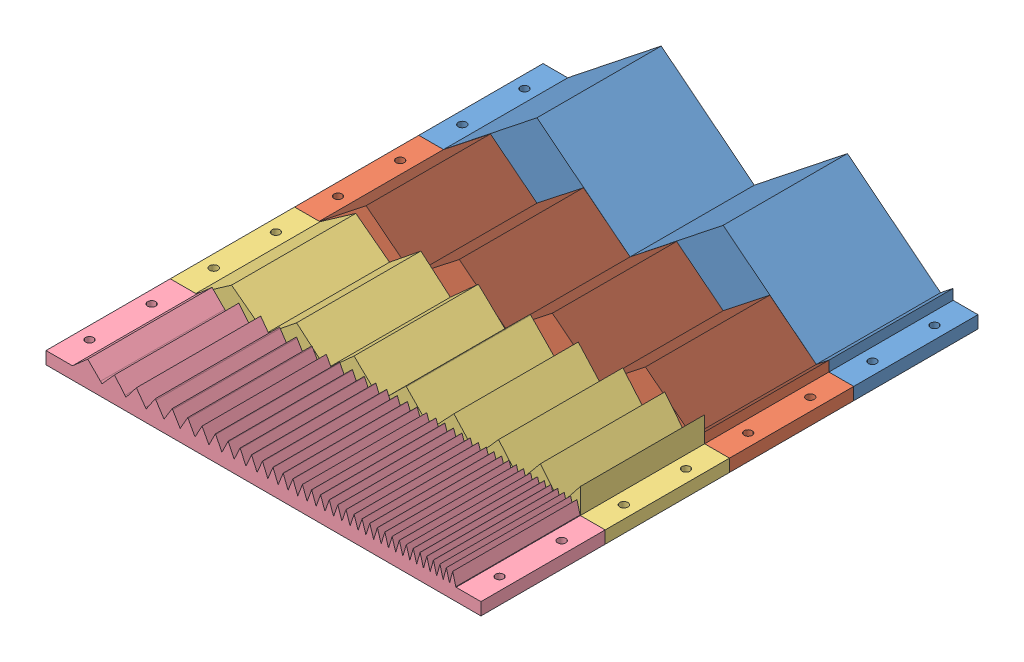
SolidWorks assembly Assem2.sldasm, configuration Default (file format 10000). Lengths in mm.
Overall size (350 69.75 400).
4 component instances, 4 part files, 3 mates.
Components (placement in the parent):
- triangRow1-1: triangRow1.SLDPRT [Default] at (-49.9447 210.2502 196.5072) size (350 69.75 100)
- triangRow2-1: triangRow2.SLDPRT [Default] at (-49.9447 210.2502 296.5072) size (350 39.75 100)
- triangRow3-1: triangRow3.SLDPRT [Default] at (-49.9447 210.2502 396.5072) size (350 30.27 100)
- triangRow4-1: triangRow4.SLDPRT [Default] at (-49.9447 210.2502 496.5072) size (350 20.84 100)
Mates (geometry in assembly coordinates):
- Coincident1: coincident: point of triangRow1-1; point of triangRow2-1
- Coincident2: coincident: point of triangRow2-1; point of triangRow3-1
- Coincident3: coincident: point of triangRow3-1; point of triangRow4-1
